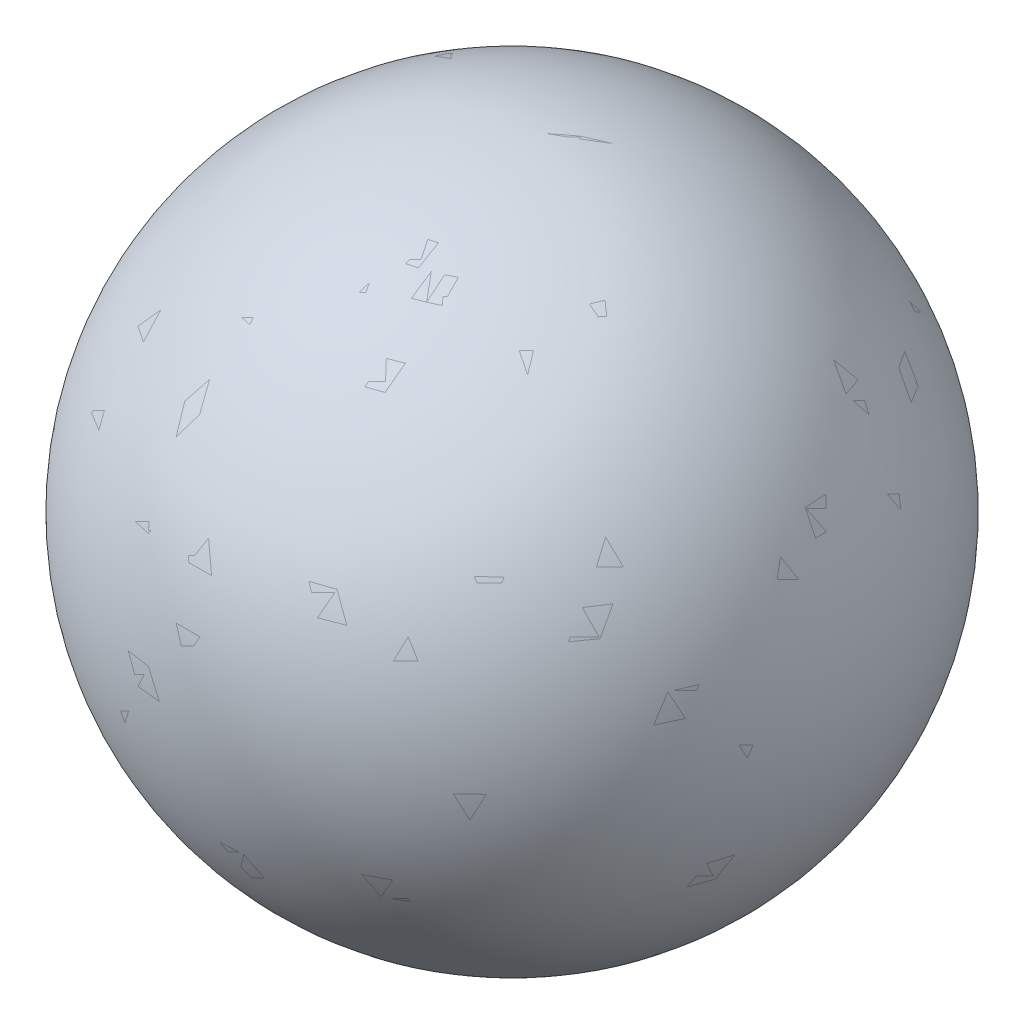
from build123d import *


with BuildPart() as part:
    # Skizze2 one side → Rotation3 (revolve)
    with BuildSketch(Plane.XY):
        with BuildLine():
            Line((0, 35), (0, -35))
            ThreePointArc((0, -35), (24.748737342, -24.748737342), (35, 0))
            ThreePointArc((35, 0), (24.748737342, 24.748737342), (0, 35))
        make_face()
    revolve(axis=Axis((0, 0, 0), (0, -1, 0)))


solid = part.part
